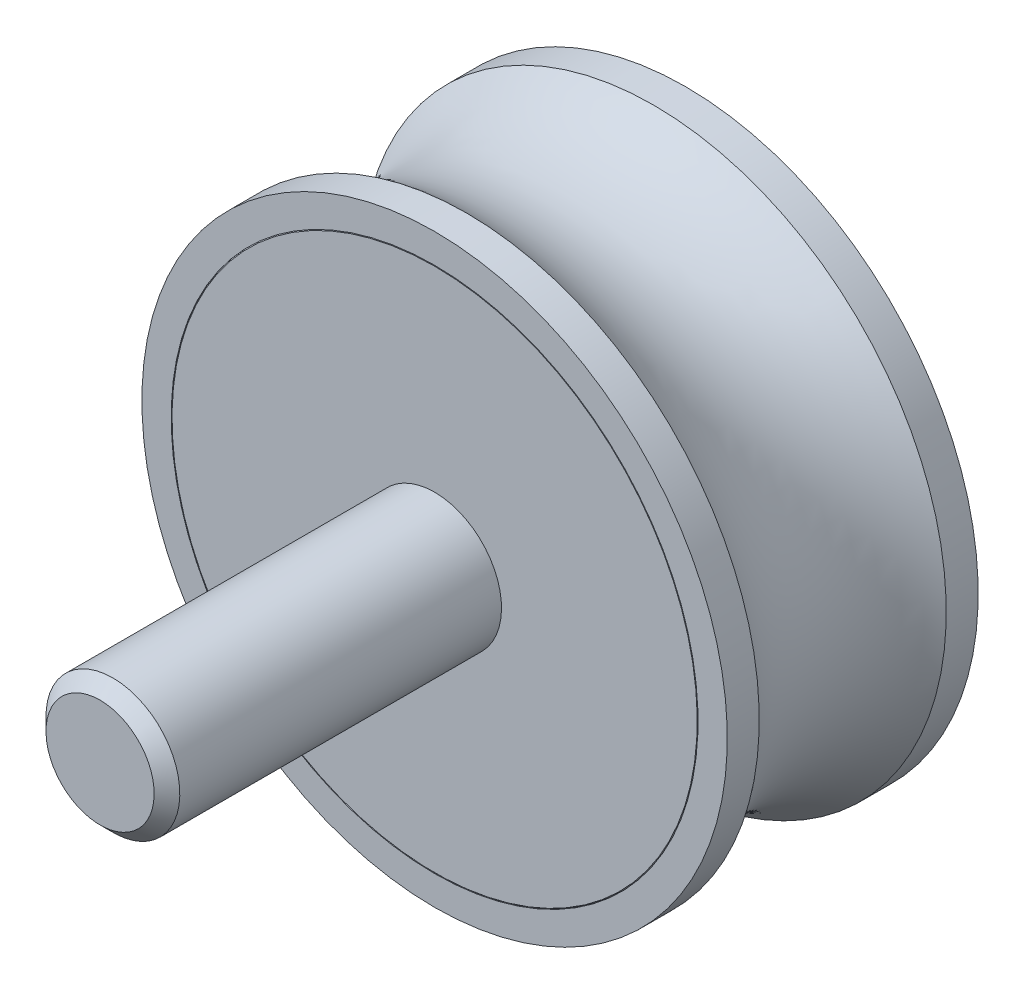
ISO-10303-21;
HEADER;
FILE_DESCRIPTION(('STEP AP214'),'2;1');
FILE_NAME('part.step','',(''),(''),'','','');
FILE_SCHEMA(('AUTOMOTIVE_DESIGN { 1 0 10303 214 1 1 1 1 }'));
ENDSEC;
DATA;
#1=APPLICATION_CONTEXT('core data for automotive mechanical design processes');
#2=APPLICATION_PROTOCOL_DEFINITION('international standard','automotive_design',2000,#1);
#3=PRODUCT_CONTEXT('',#1,'mechanical');
#4=PRODUCT('Part','Part','',(#3));
#5=PRODUCT_RELATED_PRODUCT_CATEGORY('part','',(#4));
#6=PRODUCT_DEFINITION_FORMATION('','',#4);
#7=PRODUCT_DEFINITION_CONTEXT('part definition',#1,'design');
#8=PRODUCT_DEFINITION('design','',#6,#7);
#9=PRODUCT_DEFINITION_SHAPE('','',#8);
#10=(LENGTH_UNIT() NAMED_UNIT(*) SI_UNIT(.MILLI.,.METRE.));
#11=(NAMED_UNIT(*) PLANE_ANGLE_UNIT() SI_UNIT($,.RADIAN.));
#12=(NAMED_UNIT(*) SI_UNIT($,.STERADIAN.) SOLID_ANGLE_UNIT());
#13=UNCERTAINTY_MEASURE_WITH_UNIT(LENGTH_MEASURE(1.E-05),#10,'distance_accuracy_value','');
#14=(GEOMETRIC_REPRESENTATION_CONTEXT(3) GLOBAL_UNCERTAINTY_ASSIGNED_CONTEXT((#13)) GLOBAL_UNIT_ASSIGNED_CONTEXT((#10,
#11,#12)) REPRESENTATION_CONTEXT('',''));
#15=CARTESIAN_POINT('',(0.,0.,0.));
#16=DIRECTION('',(0.,0.,1.));
#17=DIRECTION('',(1.,0.,0.));
#18=AXIS2_PLACEMENT_3D('',#15,#16,#17);
#19=CARTESIAN_POINT('',(0.,0.,0.5));
#20=DIRECTION('',(0.,0.,-1.));
#21=DIRECTION('',(0.,1.,0.));
#22=AXIS2_PLACEMENT_3D('',#19,#20,#21);
#23=CYLINDRICAL_SURFACE('',#22,15.75);
#24=CARTESIAN_POINT('',(0.,0.,0.05));
#25=DIRECTION('',(0.,0.,-1.));
#26=DIRECTION('',(0.,1.,0.));
#27=AXIS2_PLACEMENT_3D('',#24,#25,#26);
#28=CIRCLE('',#27,15.75);
#29=CARTESIAN_POINT('',(0.,15.75,0.05));
#30=VERTEX_POINT('',#29);
#31=EDGE_CURVE('E53',#30,#30,#28,.T.);
#32=ORIENTED_EDGE('',*,*,#31,.F.);
#33=EDGE_LOOP('',(#32));
#34=FACE_BOUND('',#33,.T.);
#35=CARTESIAN_POINT('',(0.,0.,0.));
#36=DIRECTION('',(0.,0.,-1.));
#37=DIRECTION('',(0.,1.,0.));
#38=AXIS2_PLACEMENT_3D('',#35,#36,#37);
#39=CIRCLE('',#38,15.75);
#40=CARTESIAN_POINT('',(0.,15.75,0.));
#41=VERTEX_POINT('',#40);
#42=EDGE_CURVE('E44',#41,#41,#39,.T.);
#43=ORIENTED_EDGE('',*,*,#42,.T.);
#44=EDGE_LOOP('',(#43));
#45=FACE_BOUND('',#44,.T.);
#46=ADVANCED_FACE('F12',(#34,#45),#23,.F.);
#47=CARTESIAN_POINT('',(0.,0.,0.5));
#48=DIRECTION('',(0.,0.,-1.));
#49=DIRECTION('',(0.,1.,0.));
#50=AXIS2_PLACEMENT_3D('',#47,#48,#49);
#51=CYLINDRICAL_SURFACE('',#50,15.75);
#52=CARTESIAN_POINT('',(0.,0.,15.));
#53=DIRECTION('',(0.,0.,-1.));
#54=DIRECTION('',(0.,1.,0.));
#55=AXIS2_PLACEMENT_3D('',#52,#53,#54);
#56=CIRCLE('',#55,15.75);
#57=CARTESIAN_POINT('',(0.,15.75,15.));
#58=VERTEX_POINT('',#57);
#59=EDGE_CURVE('E27',#58,#58,#56,.T.);
#60=ORIENTED_EDGE('',*,*,#59,.F.);
#61=EDGE_LOOP('',(#60));
#62=FACE_BOUND('',#61,.T.);
#63=CARTESIAN_POINT('',(0.,0.,14.95));
#64=DIRECTION('',(0.,0.,-1.));
#65=DIRECTION('',(0.,1.,0.));
#66=AXIS2_PLACEMENT_3D('',#63,#64,#65);
#67=CIRCLE('',#66,15.75);
#68=CARTESIAN_POINT('',(0.,15.75,14.95));
#69=VERTEX_POINT('',#68);
#70=EDGE_CURVE('E50',#69,#69,#67,.T.);
#71=ORIENTED_EDGE('',*,*,#70,.T.);
#72=EDGE_LOOP('',(#71));
#73=FACE_BOUND('',#72,.T.);
#74=ADVANCED_FACE('F89',(#62,#73),#51,.F.);
#75=CARTESIAN_POINT('',(15.75,0.,15.));
#76=DIRECTION('',(0.,0.,-1.));
#77=DIRECTION('',(0.,1.,0.));
#78=AXIS2_PLACEMENT_3D('',#75,#76,#77);
#79=PLANE('',#78);
#80=CARTESIAN_POINT('',(0.,0.,15.));
#81=DIRECTION('',(0.,0.,-1.));
#82=DIRECTION('',(0.,1.,0.));
#83=AXIS2_PLACEMENT_3D('',#80,#81,#82);
#84=CIRCLE('',#83,17.5);
#85=CARTESIAN_POINT('',(0.,17.5,15.));
#86=VERTEX_POINT('',#85);
#87=EDGE_CURVE('E32',#86,#86,#84,.T.);
#88=ORIENTED_EDGE('',*,*,#87,.F.);
#89=EDGE_LOOP('',(#88));
#90=FACE_BOUND('',#89,.T.);
#91=ORIENTED_EDGE('',*,*,#59,.T.);
#92=EDGE_LOOP('',(#91));
#93=FACE_BOUND('',#92,.T.);
#94=ADVANCED_FACE('F115',(#90,#93),#79,.F.);
#95=CARTESIAN_POINT('',(0.,0.,0.5));
#96=DIRECTION('',(0.,0.,-1.));
#97=DIRECTION('',(0.,1.,0.));
#98=AXIS2_PLACEMENT_3D('',#95,#96,#97);
#99=CYLINDRICAL_SURFACE('',#98,17.5);
#100=CARTESIAN_POINT('',(0.,0.,13.0901699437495));
#101=DIRECTION('',(0.,0.,-1.));
#102=DIRECTION('',(0.,1.,0.));
#103=AXIS2_PLACEMENT_3D('',#100,#101,#102);
#104=CIRCLE('',#103,17.5);
#105=CARTESIAN_POINT('',(0.,17.5,13.0901699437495));
#106=VERTEX_POINT('',#105);
#107=EDGE_CURVE('E35',#106,#106,#104,.T.);
#108=ORIENTED_EDGE('',*,*,#107,.F.);
#109=EDGE_LOOP('',(#108));
#110=FACE_BOUND('',#109,.T.);
#111=ORIENTED_EDGE('',*,*,#87,.T.);
#112=EDGE_LOOP('',(#111));
#113=FACE_BOUND('',#112,.T.);
#114=ADVANCED_FACE('F109',(#110,#113),#99,.T.);
#115=CARTESIAN_POINT('',(0.,0.,7.5));
#116=DIRECTION('',(0.,0.,-1.));
#117=DIRECTION('',(0.,1.,0.));
#118=AXIS2_PLACEMENT_3D('',#115,#116,#117);
#119=TOROIDAL_SURFACE('',#118,24.3125,8.8125);
#120=CARTESIAN_POINT('',(0.,0.,1.90983005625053));
#121=DIRECTION('',(0.,0.,-1.));
#122=DIRECTION('',(0.,1.,0.));
#123=AXIS2_PLACEMENT_3D('',#120,#121,#122);
#124=CIRCLE('',#123,17.5);
#125=CARTESIAN_POINT('',(0.,17.5,1.90983005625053));
#126=VERTEX_POINT('',#125);
#127=EDGE_CURVE('E38',#126,#126,#124,.T.);
#128=ORIENTED_EDGE('',*,*,#127,.F.);
#129=EDGE_LOOP('',(#128));
#130=FACE_BOUND('',#129,.T.);
#131=ORIENTED_EDGE('',*,*,#107,.T.);
#132=EDGE_LOOP('',(#131));
#133=FACE_BOUND('',#132,.T.);
#134=ADVANCED_FACE('F103',(#130,#133),#119,.F.);
#135=CARTESIAN_POINT('',(0.,0.,0.5));
#136=DIRECTION('',(0.,0.,-1.));
#137=DIRECTION('',(0.,1.,0.));
#138=AXIS2_PLACEMENT_3D('',#135,#136,#137);
#139=CYLINDRICAL_SURFACE('',#138,17.5);
#140=CARTESIAN_POINT('',(0.,0.,0.));
#141=DIRECTION('',(0.,0.,-1.));
#142=DIRECTION('',(0.,1.,0.));
#143=AXIS2_PLACEMENT_3D('',#140,#141,#142);
#144=CIRCLE('',#143,17.5);
#145=CARTESIAN_POINT('',(0.,17.5,0.));
#146=VERTEX_POINT('',#145);
#147=EDGE_CURVE('E41',#146,#146,#144,.T.);
#148=ORIENTED_EDGE('',*,*,#147,.F.);
#149=EDGE_LOOP('',(#148));
#150=FACE_BOUND('',#149,.T.);
#151=ORIENTED_EDGE('',*,*,#127,.T.);
#152=EDGE_LOOP('',(#151));
#153=FACE_BOUND('',#152,.T.);
#154=ADVANCED_FACE('F97',(#150,#153),#139,.T.);
#155=CARTESIAN_POINT('',(17.5,0.,0.));
#156=DIRECTION('',(0.,0.,1.));
#157=DIRECTION('',(0.,-1.,0.));
#158=AXIS2_PLACEMENT_3D('',#155,#156,#157);
#159=PLANE('',#158);
#160=ORIENTED_EDGE('',*,*,#42,.F.);
#161=EDGE_LOOP('',(#160));
#162=FACE_BOUND('',#161,.T.);
#163=ORIENTED_EDGE('',*,*,#147,.T.);
#164=EDGE_LOOP('',(#163));
#165=FACE_BOUND('',#164,.T.);
#166=ADVANCED_FACE('F93',(#162,#165),#159,.F.);
#167=CARTESIAN_POINT('',(0.,0.,15.));
#168=DIRECTION('',(0.,0.,-1.));
#169=DIRECTION('',(0.,1.,0.));
#170=AXIS2_PLACEMENT_3D('',#167,#168,#169);
#171=PLANE('',#170);
#172=CARTESIAN_POINT('',(0.,0.,15.));
#173=DIRECTION('',(0.,0.,-1.));
#174=DIRECTION('',(0.,1.,0.));
#175=AXIS2_PLACEMENT_3D('',#172,#173,#174);
#176=CIRCLE('',#175,15.7);
#177=CARTESIAN_POINT('',(0.,15.7,15.));
#178=VERTEX_POINT('',#177);
#179=EDGE_CURVE('E47',#178,#178,#176,.T.);
#180=ORIENTED_EDGE('',*,*,#179,.F.);
#181=EDGE_LOOP('',(#180));
#182=FACE_BOUND('',#181,.T.);
#183=CARTESIAN_POINT('',(0.,0.,15.));
#184=DIRECTION('',(0.,0.,-1.));
#185=DIRECTION('',(0.,1.,0.));
#186=AXIS2_PLACEMENT_3D('',#183,#184,#185);
#187=CIRCLE('',#186,4.);
#188=CARTESIAN_POINT('',(0.,4.,15.));
#189=VERTEX_POINT('',#188);
#190=EDGE_CURVE('E8',#189,#189,#187,.T.);
#191=ORIENTED_EDGE('',*,*,#190,.T.);
#192=EDGE_LOOP('',(#191));
#193=FACE_BOUND('',#192,.T.);
#194=ADVANCED_FACE('F96',(#182,#193),#171,.F.);
#195=CARTESIAN_POINT('',(0.,0.,15.));
#196=DIRECTION('',(0.,0.,-1.));
#197=DIRECTION('',(0.,1.,0.));
#198=AXIS2_PLACEMENT_3D('',#195,#196,#197);
#199=CONICAL_SURFACE('',#198,15.7,0.785398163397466);
#200=ORIENTED_EDGE('',*,*,#70,.F.);
#201=EDGE_LOOP('',(#200));
#202=FACE_BOUND('',#201,.T.);
#203=ORIENTED_EDGE('',*,*,#179,.T.);
#204=EDGE_LOOP('',(#203));
#205=FACE_BOUND('',#204,.T.);
#206=ADVANCED_FACE('F129',(#202,#205),#199,.T.);
#207=CARTESIAN_POINT('',(0.,0.,35.));
#208=DIRECTION('',(0.,0.,-1.));
#209=DIRECTION('',(0.,1.,0.));
#210=AXIS2_PLACEMENT_3D('',#207,#208,#209);
#211=PLANE('',#210);
#212=CARTESIAN_POINT('',(0.,0.,35.));
#213=DIRECTION('',(0.,0.,-1.));
#214=DIRECTION('',(0.,1.,0.));
#215=AXIS2_PLACEMENT_3D('',#212,#213,#214);
#216=CIRCLE('',#215,3.233);
#217=CARTESIAN_POINT('',(0.,3.233,35.));
#218=VERTEX_POINT('',#217);
#219=EDGE_CURVE('E19',#218,#218,#216,.T.);
#220=ORIENTED_EDGE('',*,*,#219,.F.);
#221=EDGE_LOOP('',(#220));
#222=FACE_BOUND('',#221,.T.);
#223=ADVANCED_FACE('F14',(#222),#211,.F.);
#224=CARTESIAN_POINT('',(0.,0.,35.));
#225=DIRECTION('',(0.,0.,-1.));
#226=DIRECTION('',(0.,1.,0.));
#227=AXIS2_PLACEMENT_3D('',#224,#225,#226);
#228=CONICAL_SURFACE('',#227,3.233,0.785398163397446);
#229=CARTESIAN_POINT('',(0.,0.,34.233));
#230=DIRECTION('',(0.,0.,-1.));
#231=DIRECTION('',(0.,1.,0.));
#232=AXIS2_PLACEMENT_3D('',#229,#230,#231);
#233=CIRCLE('',#232,4.);
#234=CARTESIAN_POINT('',(0.,4.,34.233));
#235=VERTEX_POINT('',#234);
#236=EDGE_CURVE('E23',#235,#235,#233,.T.);
#237=ORIENTED_EDGE('',*,*,#236,.F.);
#238=EDGE_LOOP('',(#237));
#239=FACE_BOUND('',#238,.T.);
#240=ORIENTED_EDGE('',*,*,#219,.T.);
#241=EDGE_LOOP('',(#240));
#242=FACE_BOUND('',#241,.T.);
#243=ADVANCED_FACE('F142',(#239,#242),#228,.T.);
#244=CARTESIAN_POINT('',(0.,0.,0.5));
#245=DIRECTION('',(0.,0.,-1.));
#246=DIRECTION('',(0.,1.,0.));
#247=AXIS2_PLACEMENT_3D('',#244,#245,#246);
#248=CYLINDRICAL_SURFACE('',#247,4.);
#249=ORIENTED_EDGE('',*,*,#190,.F.);
#250=EDGE_LOOP('',(#249));
#251=FACE_BOUND('',#250,.T.);
#252=ORIENTED_EDGE('',*,*,#236,.T.);
#253=EDGE_LOOP('',(#252));
#254=FACE_BOUND('',#253,.T.);
#255=ADVANCED_FACE('F83',(#251,#254),#248,.T.);
#256=CARTESIAN_POINT('',(0.,0.,0.05));
#257=DIRECTION('',(0.,0.,1.));
#258=DIRECTION('',(0.,-1.,0.));
#259=AXIS2_PLACEMENT_3D('',#256,#257,#258);
#260=CONICAL_SURFACE('',#259,15.75,0.785398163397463);
#261=CARTESIAN_POINT('',(0.,0.,0.));
#262=DIRECTION('',(0.,0.,-1.));
#263=DIRECTION('',(0.,1.,0.));
#264=AXIS2_PLACEMENT_3D('',#261,#262,#263);
#265=CIRCLE('',#264,15.7);
#266=CARTESIAN_POINT('',(0.,15.7,0.));
#267=VERTEX_POINT('',#266);
#268=EDGE_CURVE('E56',#267,#267,#265,.T.);
#269=ORIENTED_EDGE('',*,*,#268,.F.);
#270=EDGE_LOOP('',(#269));
#271=FACE_BOUND('',#270,.T.);
#272=ORIENTED_EDGE('',*,*,#31,.T.);
#273=EDGE_LOOP('',(#272));
#274=FACE_BOUND('',#273,.T.);
#275=ADVANCED_FACE('F77',(#271,#274),#260,.T.);
#276=CARTESIAN_POINT('',(15.7,0.,0.));
#277=DIRECTION('',(0.,0.,1.));
#278=DIRECTION('',(0.,-1.,0.));
#279=AXIS2_PLACEMENT_3D('',#276,#277,#278);
#280=PLANE('',#279);
#281=CARTESIAN_POINT('',(0.,0.,0.));
#282=DIRECTION('',(0.,0.,-1.));
#283=DIRECTION('',(0.,1.,0.));
#284=AXIS2_PLACEMENT_3D('',#281,#282,#283);
#285=CIRCLE('',#284,4.);
#286=CARTESIAN_POINT('',(0.,4.,0.));
#287=VERTEX_POINT('',#286);
#288=EDGE_CURVE('E60',#287,#287,#285,.T.);
#289=ORIENTED_EDGE('',*,*,#288,.F.);
#290=EDGE_LOOP('',(#289));
#291=FACE_BOUND('',#290,.T.);
#292=ORIENTED_EDGE('',*,*,#268,.T.);
#293=EDGE_LOOP('',(#292));
#294=FACE_BOUND('',#293,.T.);
#295=ADVANCED_FACE('F71',(#291,#294),#280,.F.);
#296=CARTESIAN_POINT('',(0.,0.,8.));
#297=DIRECTION('',(0.,0.,-1.));
#298=DIRECTION('',(0.,1.,0.));
#299=AXIS2_PLACEMENT_3D('',#296,#297,#298);
#300=CYLINDRICAL_SURFACE('',#299,4.);
#301=CARTESIAN_POINT('',(0.,0.,8.));
#302=DIRECTION('',(0.,0.,-1.));
#303=DIRECTION('',(0.,1.,0.));
#304=AXIS2_PLACEMENT_3D('',#301,#302,#303);
#305=CIRCLE('',#304,4.);
#306=CARTESIAN_POINT('',(0.,4.,8.));
#307=VERTEX_POINT('',#306);
#308=EDGE_CURVE('E59',#307,#307,#305,.T.);
#309=ORIENTED_EDGE('',*,*,#308,.F.);
#310=EDGE_LOOP('',(#309));
#311=FACE_BOUND('',#310,.T.);
#312=ORIENTED_EDGE('',*,*,#288,.T.);
#313=EDGE_LOOP('',(#312));
#314=FACE_BOUND('',#313,.T.);
#315=ADVANCED_FACE('F68',(#311,#314),#300,.F.);
#316=CARTESIAN_POINT('',(0.,0.,8.));
#317=DIRECTION('',(0.,0.,-1.));
#318=DIRECTION('',(0.,1.,0.));
#319=AXIS2_PLACEMENT_3D('',#316,#317,#318);
#320=PLANE('',#319);
#321=ORIENTED_EDGE('',*,*,#308,.T.);
#322=EDGE_LOOP('',(#321));
#323=FACE_BOUND('',#322,.T.);
#324=ADVANCED_FACE('F66',(#323),#320,.T.);
#325=CLOSED_SHELL('',(#46,#74,#94,#114,#134,#154,#166,#194,#206,#223,#243,#255,#275,#295,#315,#324));
#326=MANIFOLD_SOLID_BREP('B1',#325);
#327=ADVANCED_BREP_SHAPE_REPRESENTATION('',(#18,#326),#14);
#328=SHAPE_DEFINITION_REPRESENTATION(#9,#327);
ENDSEC;
END-ISO-10303-21;
